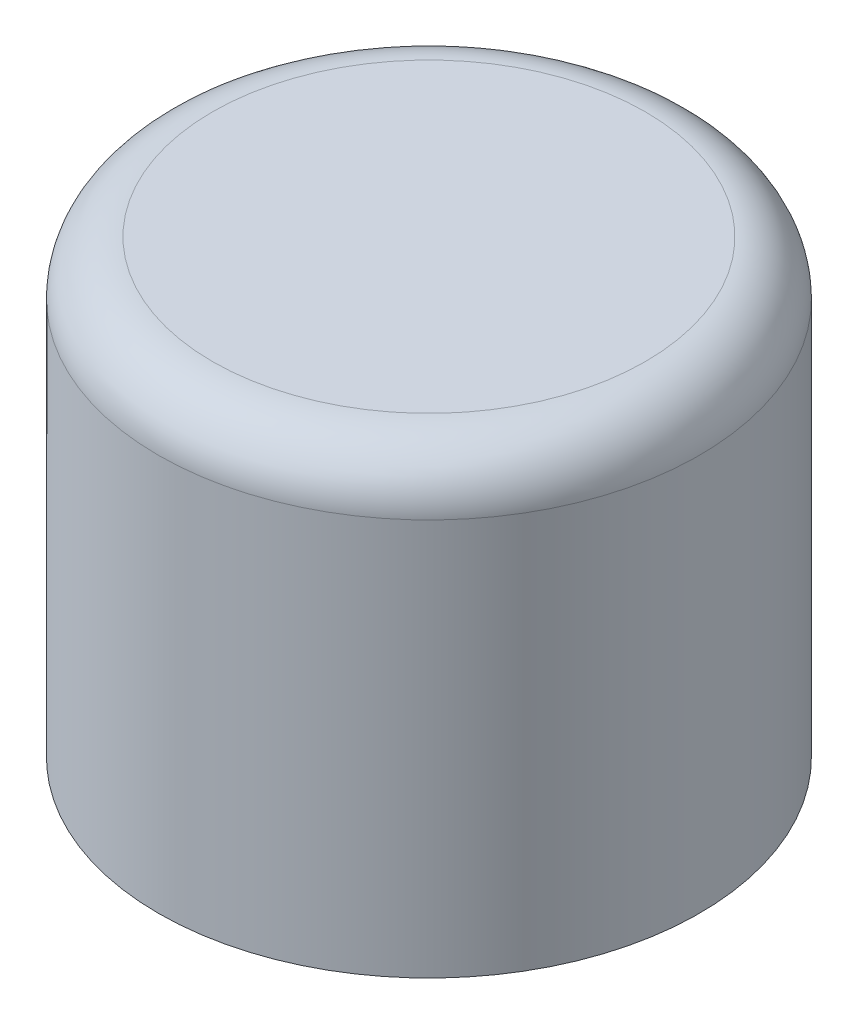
from build123d import *

# Parameters (mm, degrees)
SKETCH1_R      = 3.81
EXTRUDE1_DEPTH = 6.35
FILLET1_R      = 0.762


with BuildPart() as part:
    # Sketch1 → Extrude1 (new body)
    with BuildSketch(Plane(origin=(0, 0, 0), x_dir=(1, 0, 0), z_dir=(0, 1, 0))):
        with Locations(Location((0, 0, 0), (0, 0, 270))):
            Circle(SKETCH1_R)
    extrude(amount=EXTRUDE1_DEPTH)

    # Fillet1
    fillet1_edges = [part.edges().sort_by_distance(p)[0] for p in [
        (0, 6.35, -3.81),
    ]]
    fillet(fillet1_edges, radius=FILLET1_R)


solid = part.part
